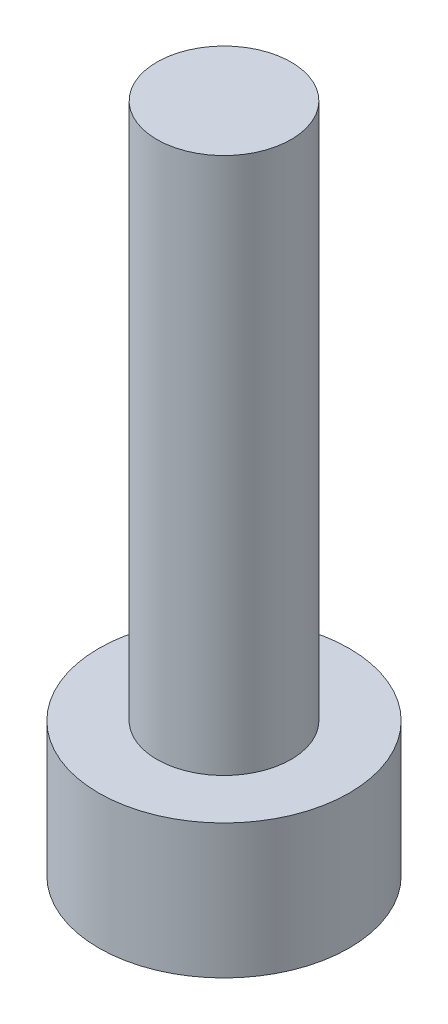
ISO-10303-21;
HEADER;
FILE_DESCRIPTION(('STEP AP214'),'2;1');
FILE_NAME('part.step','',(''),(''),'','','');
FILE_SCHEMA(('AUTOMOTIVE_DESIGN { 1 0 10303 214 1 1 1 1 }'));
ENDSEC;
DATA;
#1=APPLICATION_CONTEXT('core data for automotive mechanical design processes');
#2=APPLICATION_PROTOCOL_DEFINITION('international standard','automotive_design',2000,#1);
#3=PRODUCT_CONTEXT('',#1,'mechanical');
#4=PRODUCT('Part','Part','',(#3));
#5=PRODUCT_RELATED_PRODUCT_CATEGORY('part','',(#4));
#6=PRODUCT_DEFINITION_FORMATION('','',#4);
#7=PRODUCT_DEFINITION_CONTEXT('part definition',#1,'design');
#8=PRODUCT_DEFINITION('design','',#6,#7);
#9=PRODUCT_DEFINITION_SHAPE('','',#8);
#10=(LENGTH_UNIT() NAMED_UNIT(*) SI_UNIT(.MILLI.,.METRE.));
#11=(NAMED_UNIT(*) PLANE_ANGLE_UNIT() SI_UNIT($,.RADIAN.));
#12=(NAMED_UNIT(*) SI_UNIT($,.STERADIAN.) SOLID_ANGLE_UNIT());
#13=UNCERTAINTY_MEASURE_WITH_UNIT(LENGTH_MEASURE(1.E-05),#10,'distance_accuracy_value','');
#14=(GEOMETRIC_REPRESENTATION_CONTEXT(3) GLOBAL_UNCERTAINTY_ASSIGNED_CONTEXT((#13)) GLOBAL_UNIT_ASSIGNED_CONTEXT((#10,
#11,#12)) REPRESENTATION_CONTEXT('',''));
#15=CARTESIAN_POINT('',(0.,0.,0.));
#16=DIRECTION('',(0.,0.,1.));
#17=DIRECTION('',(1.,0.,0.));
#18=AXIS2_PLACEMENT_3D('',#15,#16,#17);
#19=CARTESIAN_POINT('',(0.,3.,0.));
#20=DIRECTION('',(0.,-1.,0.));
#21=DIRECTION('',(0.,0.,-1.));
#22=AXIS2_PLACEMENT_3D('',#19,#20,#21);
#23=CYLINDRICAL_SURFACE('',#22,2.8);
#24=CARTESIAN_POINT('',(0.,3.,0.));
#25=DIRECTION('',(0.,1.,0.));
#26=DIRECTION('',(0.,0.,1.));
#27=AXIS2_PLACEMENT_3D('',#24,#25,#26);
#28=CIRCLE('',#27,2.8);
#29=CARTESIAN_POINT('',(0.,3.,2.8));
#30=VERTEX_POINT('',#29);
#31=EDGE_CURVE('E51',#30,#30,#28,.T.);
#32=ORIENTED_EDGE('',*,*,#31,.F.);
#33=EDGE_LOOP('',(#32));
#34=FACE_BOUND('',#33,.T.);
#35=CARTESIAN_POINT('',(0.,0.,0.));
#36=DIRECTION('',(0.,1.,0.));
#37=DIRECTION('',(0.,0.,1.));
#38=AXIS2_PLACEMENT_3D('',#35,#36,#37);
#39=CIRCLE('',#38,2.8);
#40=CARTESIAN_POINT('',(0.,0.,2.8));
#41=VERTEX_POINT('',#40);
#42=EDGE_CURVE('E46',#41,#41,#39,.T.);
#43=ORIENTED_EDGE('',*,*,#42,.T.);
#44=EDGE_LOOP('',(#43));
#45=FACE_BOUND('',#44,.T.);
#46=ADVANCED_FACE('F43',(#34,#45),#23,.T.);
#47=CARTESIAN_POINT('',(0.,3.,0.));
#48=DIRECTION('',(0.,1.,0.));
#49=DIRECTION('',(0.,0.,1.));
#50=AXIS2_PLACEMENT_3D('',#47,#48,#49);
#51=PLANE('',#50);
#52=CARTESIAN_POINT('',(0.,3.,0.));
#53=DIRECTION('',(0.,1.,0.));
#54=DIRECTION('',(0.,0.,1.));
#55=AXIS2_PLACEMENT_3D('',#52,#53,#54);
#56=CIRCLE('',#55,1.5);
#57=CARTESIAN_POINT('',(0.,3.,1.5));
#58=VERTEX_POINT('',#57);
#59=EDGE_CURVE('E11',#58,#58,#56,.T.);
#60=ORIENTED_EDGE('',*,*,#59,.F.);
#61=EDGE_LOOP('',(#60));
#62=FACE_BOUND('',#61,.T.);
#63=ORIENTED_EDGE('',*,*,#31,.T.);
#64=EDGE_LOOP('',(#63));
#65=FACE_BOUND('',#64,.T.);
#66=ADVANCED_FACE('F161',(#62,#65),#51,.T.);
#67=CARTESIAN_POINT('',(0.,0.,0.));
#68=DIRECTION('',(0.,1.,0.));
#69=DIRECTION('',(0.,0.,1.));
#70=AXIS2_PLACEMENT_3D('',#67,#68,#69);
#71=PLANE('',#70);
#72=DIRECTION('',(0.195712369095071,0.,0.980661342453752));
#73=VECTOR('',#72,1.);
#74=CARTESIAN_POINT('',(1.08458344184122,0.,-0.952371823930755));
#75=LINE('',#74,#73);
#76=CARTESIAN_POINT('',(1.08458344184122,0.,-0.952371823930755));
#77=VERTEX_POINT('',#76);
#78=CARTESIAN_POINT('',(1.36706991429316,0.,0.463090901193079));
#79=VERTEX_POINT('',#78);
#80=EDGE_CURVE('E135',#77,#79,#75,.T.);
#81=ORIENTED_EDGE('',*,*,#80,.F.);
#82=DIRECTION('',(0.947133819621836,0.,0.320838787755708));
#83=VECTOR('',#82,1.);
#84=CARTESIAN_POINT('',(-0.282486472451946,0.,-1.41546272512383));
#85=LINE('',#84,#83);
#86=CARTESIAN_POINT('',(-0.282486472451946,0.,-1.41546272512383));
#87=VERTEX_POINT('',#86);
#88=EDGE_CURVE('E56',#87,#77,#85,.T.);
#89=ORIENTED_EDGE('',*,*,#88,.F.);
#90=DIRECTION('',(0.751421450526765,0.,-0.659822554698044));
#91=VECTOR('',#90,1.);
#92=CARTESIAN_POINT('',(-1.36706991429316,0.,-0.463090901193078));
#93=LINE('',#92,#91);
#94=CARTESIAN_POINT('',(-1.36706991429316,0.,-0.463090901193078));
#95=VERTEX_POINT('',#94);
#96=EDGE_CURVE('E145',#95,#87,#93,.T.);
#97=ORIENTED_EDGE('',*,*,#96,.F.);
#98=DIRECTION('',(-0.195712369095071,0.,-0.980661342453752));
#99=VECTOR('',#98,1.);
#100=CARTESIAN_POINT('',(-1.08458344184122,0.,0.952371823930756));
#101=LINE('',#100,#99);
#102=CARTESIAN_POINT('',(-1.08458344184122,0.,0.952371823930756));
#103=VERTEX_POINT('',#102);
#104=EDGE_CURVE('E140',#103,#95,#101,.T.);
#105=ORIENTED_EDGE('',*,*,#104,.F.);
#106=DIRECTION('',(-0.947133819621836,0.,-0.320838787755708));
#107=VECTOR('',#106,1.);
#108=CARTESIAN_POINT('',(0.282486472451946,0.,1.41546272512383));
#109=LINE('',#108,#107);
#110=CARTESIAN_POINT('',(0.282486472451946,0.,1.41546272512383));
#111=VERTEX_POINT('',#110);
#112=EDGE_CURVE('E110',#111,#103,#109,.T.);
#113=ORIENTED_EDGE('',*,*,#112,.F.);
#114=DIRECTION('',(-0.751421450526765,0.,0.659822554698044));
#115=VECTOR('',#114,1.);
#116=CARTESIAN_POINT('',(1.36706991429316,0.,0.463090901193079));
#117=LINE('',#116,#115);
#118=EDGE_CURVE('E136',#79,#111,#117,.T.);
#119=ORIENTED_EDGE('',*,*,#118,.F.);
#120=EDGE_LOOP('',(#81,#89,#97,#105,#113,#119));
#121=FACE_BOUND('',#120,.T.);
#122=ORIENTED_EDGE('',*,*,#42,.F.);
#123=EDGE_LOOP('',(#122));
#124=FACE_BOUND('',#123,.T.);
#125=ADVANCED_FACE('F160',(#121,#124),#71,.F.);
#126=CARTESIAN_POINT('',(0.,15.,0.));
#127=DIRECTION('',(0.,-1.,0.));
#128=DIRECTION('',(0.,0.,-1.));
#129=AXIS2_PLACEMENT_3D('',#126,#127,#128);
#130=CYLINDRICAL_SURFACE('',#129,1.5);
#131=CARTESIAN_POINT('',(0.,15.,0.));
#132=DIRECTION('',(0.,1.,0.));
#133=DIRECTION('',(0.,0.,1.));
#134=AXIS2_PLACEMENT_3D('',#131,#132,#133);
#135=CIRCLE('',#134,1.5);
#136=CARTESIAN_POINT('',(0.,15.,1.5));
#137=VERTEX_POINT('',#136);
#138=EDGE_CURVE('E147',#137,#137,#135,.T.);
#139=ORIENTED_EDGE('',*,*,#138,.F.);
#140=EDGE_LOOP('',(#139));
#141=FACE_BOUND('',#140,.T.);
#142=ORIENTED_EDGE('',*,*,#59,.T.);
#143=EDGE_LOOP('',(#142));
#144=FACE_BOUND('',#143,.T.);
#145=ADVANCED_FACE('F162',(#141,#144),#130,.T.);
#146=CARTESIAN_POINT('',(0.,15.,0.));
#147=DIRECTION('',(0.,1.,0.));
#148=DIRECTION('',(0.,0.,1.));
#149=AXIS2_PLACEMENT_3D('',#146,#147,#148);
#150=PLANE('',#149);
#151=ORIENTED_EDGE('',*,*,#138,.T.);
#152=EDGE_LOOP('',(#151));
#153=FACE_BOUND('',#152,.T.);
#154=ADVANCED_FACE('F167',(#153),#150,.T.);
#155=CARTESIAN_POINT('',(-0.282486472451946,1.5,-1.41546272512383));
#156=DIRECTION('',(0.320838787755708,0.,-0.947133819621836));
#157=DIRECTION('',(-0.947133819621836,0.,-0.320838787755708));
#158=AXIS2_PLACEMENT_3D('',#155,#156,#157);
#159=PLANE('',#158);
#160=ORIENTED_EDGE('',*,*,#88,.T.);
#161=DIRECTION('',(0.,-1.,0.));
#162=VECTOR('',#161,1.);
#163=CARTESIAN_POINT('',(1.08458344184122,1.5,-0.952371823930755));
#164=LINE('',#163,#162);
#165=CARTESIAN_POINT('',(1.08458344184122,1.5,-0.952371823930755));
#166=VERTEX_POINT('',#165);
#167=EDGE_CURVE('E88',#166,#77,#164,.T.);
#168=ORIENTED_EDGE('',*,*,#167,.F.);
#169=DIRECTION('',(0.947133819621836,0.,0.320838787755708));
#170=VECTOR('',#169,1.);
#171=CARTESIAN_POINT('',(-0.282486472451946,1.5,-1.41546272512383));
#172=LINE('',#171,#170);
#173=CARTESIAN_POINT('',(-0.282486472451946,1.5,-1.41546272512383));
#174=VERTEX_POINT('',#173);
#175=EDGE_CURVE('E144',#174,#166,#172,.T.);
#176=ORIENTED_EDGE('',*,*,#175,.F.);
#177=DIRECTION('',(0.,-1.,0.));
#178=VECTOR('',#177,1.);
#179=CARTESIAN_POINT('',(-0.282486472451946,1.5,-1.41546272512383));
#180=LINE('',#179,#178);
#181=EDGE_CURVE('E66',#174,#87,#180,.T.);
#182=ORIENTED_EDGE('',*,*,#181,.T.);
#183=EDGE_LOOP('',(#160,#168,#176,#182));
#184=FACE_BOUND('',#183,.T.);
#185=ADVANCED_FACE('F200',(#184),#159,.F.);
#186=CARTESIAN_POINT('',(-1.36706991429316,1.5,-0.463090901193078));
#187=DIRECTION('',(-0.659822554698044,0.,-0.751421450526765));
#188=DIRECTION('',(-0.751421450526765,0.,0.659822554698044));
#189=AXIS2_PLACEMENT_3D('',#186,#187,#188);
#190=PLANE('',#189);
#191=ORIENTED_EDGE('',*,*,#96,.T.);
#192=ORIENTED_EDGE('',*,*,#181,.F.);
#193=DIRECTION('',(0.751421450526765,0.,-0.659822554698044));
#194=VECTOR('',#193,1.);
#195=CARTESIAN_POINT('',(-1.36706991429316,1.5,-0.463090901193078));
#196=LINE('',#195,#194);
#197=CARTESIAN_POINT('',(-1.36706991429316,1.5,-0.463090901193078));
#198=VERTEX_POINT('',#197);
#199=EDGE_CURVE('E118',#198,#174,#196,.T.);
#200=ORIENTED_EDGE('',*,*,#199,.F.);
#201=DIRECTION('',(0.,-1.,0.));
#202=VECTOR('',#201,1.);
#203=CARTESIAN_POINT('',(-1.36706991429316,1.5,-0.463090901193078));
#204=LINE('',#203,#202);
#205=EDGE_CURVE('E111',#198,#95,#204,.T.);
#206=ORIENTED_EDGE('',*,*,#205,.T.);
#207=EDGE_LOOP('',(#191,#192,#200,#206));
#208=FACE_BOUND('',#207,.T.);
#209=ADVANCED_FACE('F208',(#208),#190,.F.);
#210=CARTESIAN_POINT('',(-1.08458344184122,1.5,0.952371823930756));
#211=DIRECTION('',(-0.980661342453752,0.,0.195712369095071));
#212=DIRECTION('',(0.195712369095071,0.,0.980661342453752));
#213=AXIS2_PLACEMENT_3D('',#210,#211,#212);
#214=PLANE('',#213);
#215=ORIENTED_EDGE('',*,*,#104,.T.);
#216=ORIENTED_EDGE('',*,*,#205,.F.);
#217=DIRECTION('',(-0.195712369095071,0.,-0.980661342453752));
#218=VECTOR('',#217,1.);
#219=CARTESIAN_POINT('',(-1.08458344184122,1.5,0.952371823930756));
#220=LINE('',#219,#218);
#221=CARTESIAN_POINT('',(-1.08458344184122,1.5,0.952371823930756));
#222=VERTEX_POINT('',#221);
#223=EDGE_CURVE('E114',#222,#198,#220,.T.);
#224=ORIENTED_EDGE('',*,*,#223,.F.);
#225=DIRECTION('',(0.,-1.,0.));
#226=VECTOR('',#225,1.);
#227=CARTESIAN_POINT('',(-1.08458344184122,1.5,0.952371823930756));
#228=LINE('',#227,#226);
#229=EDGE_CURVE('E99',#222,#103,#228,.T.);
#230=ORIENTED_EDGE('',*,*,#229,.T.);
#231=EDGE_LOOP('',(#215,#216,#224,#230));
#232=FACE_BOUND('',#231,.T.);
#233=ADVANCED_FACE('F116',(#232),#214,.F.);
#234=CARTESIAN_POINT('',(0.282486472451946,1.5,1.41546272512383));
#235=DIRECTION('',(-0.320838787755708,0.,0.947133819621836));
#236=DIRECTION('',(0.947133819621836,0.,0.320838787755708));
#237=AXIS2_PLACEMENT_3D('',#234,#235,#236);
#238=PLANE('',#237);
#239=ORIENTED_EDGE('',*,*,#112,.T.);
#240=ORIENTED_EDGE('',*,*,#229,.F.);
#241=DIRECTION('',(-0.947133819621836,0.,-0.320838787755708));
#242=VECTOR('',#241,1.);
#243=CARTESIAN_POINT('',(0.282486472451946,1.5,1.41546272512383));
#244=LINE('',#243,#242);
#245=CARTESIAN_POINT('',(0.282486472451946,1.5,1.41546272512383));
#246=VERTEX_POINT('',#245);
#247=EDGE_CURVE('E104',#246,#222,#244,.T.);
#248=ORIENTED_EDGE('',*,*,#247,.F.);
#249=DIRECTION('',(0.,-1.,0.));
#250=VECTOR('',#249,1.);
#251=CARTESIAN_POINT('',(0.282486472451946,1.5,1.41546272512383));
#252=LINE('',#251,#250);
#253=EDGE_CURVE('E115',#246,#111,#252,.T.);
#254=ORIENTED_EDGE('',*,*,#253,.T.);
#255=EDGE_LOOP('',(#239,#240,#248,#254));
#256=FACE_BOUND('',#255,.T.);
#257=ADVANCED_FACE('F105',(#256),#238,.F.);
#258=CARTESIAN_POINT('',(1.36706991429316,1.5,0.463090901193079));
#259=DIRECTION('',(0.659822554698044,0.,0.751421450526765));
#260=DIRECTION('',(0.751421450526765,0.,-0.659822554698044));
#261=AXIS2_PLACEMENT_3D('',#258,#259,#260);
#262=PLANE('',#261);
#263=ORIENTED_EDGE('',*,*,#118,.T.);
#264=ORIENTED_EDGE('',*,*,#253,.F.);
#265=DIRECTION('',(-0.751421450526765,0.,0.659822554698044));
#266=VECTOR('',#265,1.);
#267=CARTESIAN_POINT('',(1.36706991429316,1.5,0.463090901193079));
#268=LINE('',#267,#266);
#269=CARTESIAN_POINT('',(1.36706991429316,1.5,0.463090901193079));
#270=VERTEX_POINT('',#269);
#271=EDGE_CURVE('E123',#270,#246,#268,.T.);
#272=ORIENTED_EDGE('',*,*,#271,.F.);
#273=DIRECTION('',(0.,-1.,0.));
#274=VECTOR('',#273,1.);
#275=CARTESIAN_POINT('',(1.36706991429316,1.5,0.463090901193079));
#276=LINE('',#275,#274);
#277=EDGE_CURVE('E146',#270,#79,#276,.T.);
#278=ORIENTED_EDGE('',*,*,#277,.T.);
#279=EDGE_LOOP('',(#263,#264,#272,#278));
#280=FACE_BOUND('',#279,.T.);
#281=ADVANCED_FACE('F232',(#280),#262,.F.);
#282=CARTESIAN_POINT('',(1.08458344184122,1.5,-0.952371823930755));
#283=DIRECTION('',(0.980661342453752,0.,-0.195712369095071));
#284=DIRECTION('',(-0.195712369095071,0.,-0.980661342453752));
#285=AXIS2_PLACEMENT_3D('',#282,#283,#284);
#286=PLANE('',#285);
#287=ORIENTED_EDGE('',*,*,#80,.T.);
#288=ORIENTED_EDGE('',*,*,#277,.F.);
#289=DIRECTION('',(0.195712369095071,0.,0.980661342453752));
#290=VECTOR('',#289,1.);
#291=CARTESIAN_POINT('',(1.08458344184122,1.5,-0.952371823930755));
#292=LINE('',#291,#290);
#293=EDGE_CURVE('E130',#166,#270,#292,.T.);
#294=ORIENTED_EDGE('',*,*,#293,.F.);
#295=ORIENTED_EDGE('',*,*,#167,.T.);
#296=EDGE_LOOP('',(#287,#288,#294,#295));
#297=FACE_BOUND('',#296,.T.);
#298=ADVANCED_FACE('F242',(#297),#286,.F.);
#299=CARTESIAN_POINT('',(0.,1.5,0.));
#300=DIRECTION('',(0.,-1.,0.));
#301=DIRECTION('',(0.,0.,-1.));
#302=AXIS2_PLACEMENT_3D('',#299,#300,#301);
#303=PLANE('',#302);
#304=ORIENTED_EDGE('',*,*,#175,.T.);
#305=ORIENTED_EDGE('',*,*,#293,.T.);
#306=ORIENTED_EDGE('',*,*,#271,.T.);
#307=ORIENTED_EDGE('',*,*,#247,.T.);
#308=ORIENTED_EDGE('',*,*,#223,.T.);
#309=ORIENTED_EDGE('',*,*,#199,.T.);
#310=EDGE_LOOP('',(#304,#305,#306,#307,#308,#309));
#311=FACE_BOUND('',#310,.T.);
#312=ADVANCED_FACE('F125',(#311),#303,.T.);
#313=CLOSED_SHELL('',(#46,#66,#125,#145,#154,#185,#209,#233,#257,#281,#298,#312));
#314=MANIFOLD_SOLID_BREP('B2',#313);
#315=ADVANCED_BREP_SHAPE_REPRESENTATION('',(#18,#314),#14);
#316=SHAPE_DEFINITION_REPRESENTATION(#9,#315);
ENDSEC;
END-ISO-10303-21;
